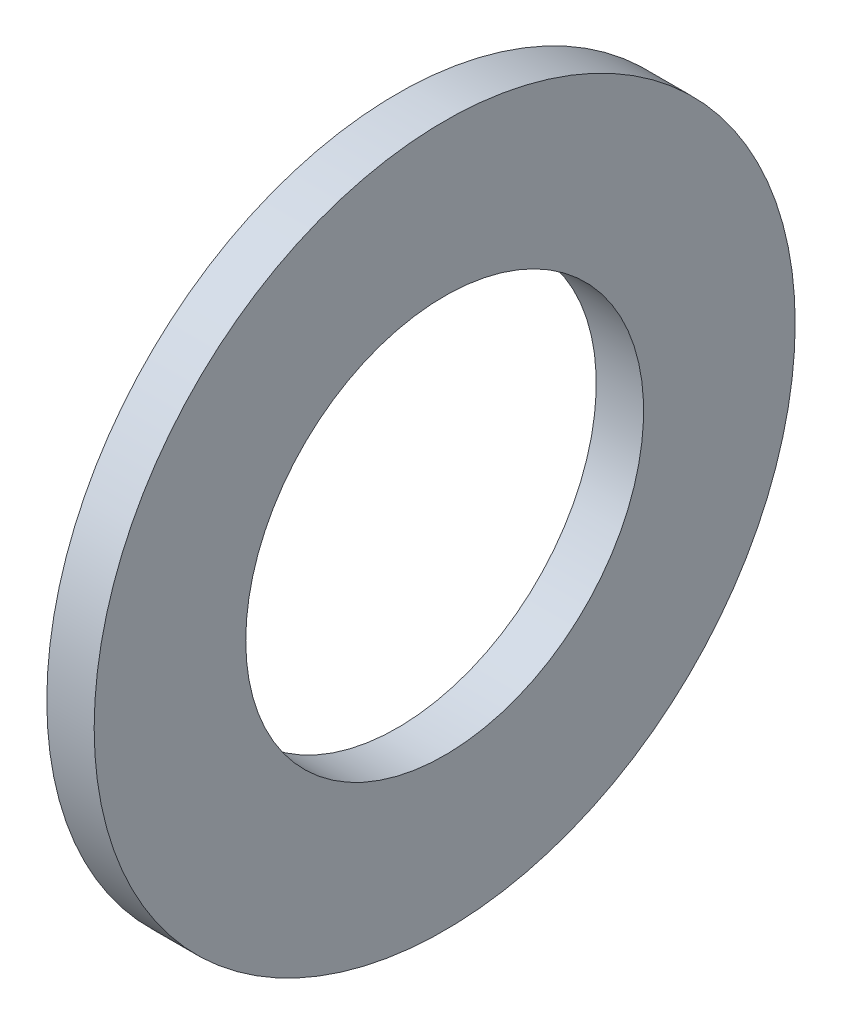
from build123d import *

# Parameters (mm, degrees)
ESQUISSE1_W = 2.5
ESQUISSE1_H = 8


with BuildPart() as part:
    # Esquisse1 → Base-R_volution (revolve)
    with BuildSketch(Plane.XY, mode=Mode.PRIVATE) as base_r_volution_sk:
        with Locations((1.25, 14.5)):
            Rectangle(ESQUISSE1_W, ESQUISSE1_H)
    revolve(base_r_volution_sk.sketch.rotate(Axis((0, 0, 0), (1, 0, 0)), 90), axis=Axis((0, 0, 0), (1, 0, 0)))


solid = part.part
